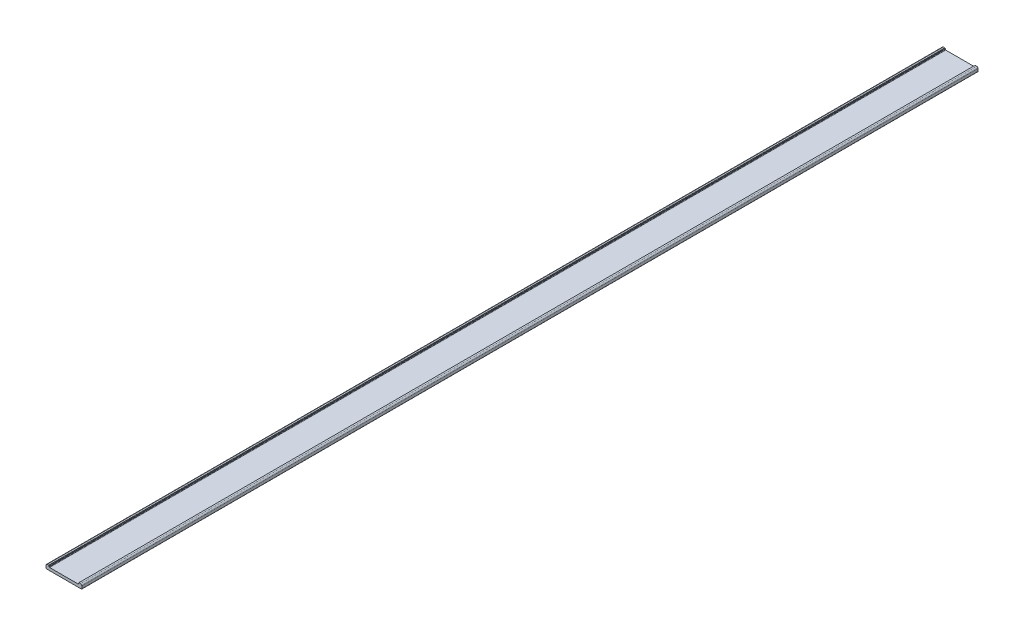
from build123d import *

# Parameters (mm, degrees)
BOSS_EXTRUDE1_DEPTH = 1000


with BuildPart() as part:
    # Sketch1 → Boss-Extrude1 (new body)
    with BuildSketch(Plane.XY):
        with BuildLine():
            Line((36.75, 4.8), (38.5, 4.8))
            ThreePointArc((38.5, 4.8), (39.560660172, 4.360660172), (40, 3.3))
            Line((40, 3.3), (40, 0.5))
            ThreePointArc((40, 0.5), (39.853553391, 0.146446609), (39.5, 0))
            Line((39.5, 0), (0.5, 0))
            ThreePointArc((0.5, 0), (0.146446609, 0.146446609), (0, 0.5))
            Line((0, 0.5), (0, 3.3))
            ThreePointArc((0, 3.3), (0.439339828, 4.360660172), (1.5, 4.8))
            Line((1.5, 4.8), (3, 4.8))
            Line((3, 4.8), (3.5, 4.3))
            Line((3.5, 4.3), (3.5, 3.6))
            ThreePointArc((3.5, 3.6), (3.646446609, 3.246446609), (4, 3.1))
            Line((4, 3.1), (36, 3.1))
            ThreePointArc((36, 3.1), (36.353553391, 3.246446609), (36.5, 3.6))
            Line((36.5, 3.6), (36.5, 4.55))
            Line((36.5, 4.55), (36.75, 4.8))
        make_face()
    extrude(amount=-BOSS_EXTRUDE1_DEPTH)


solid = part.part
